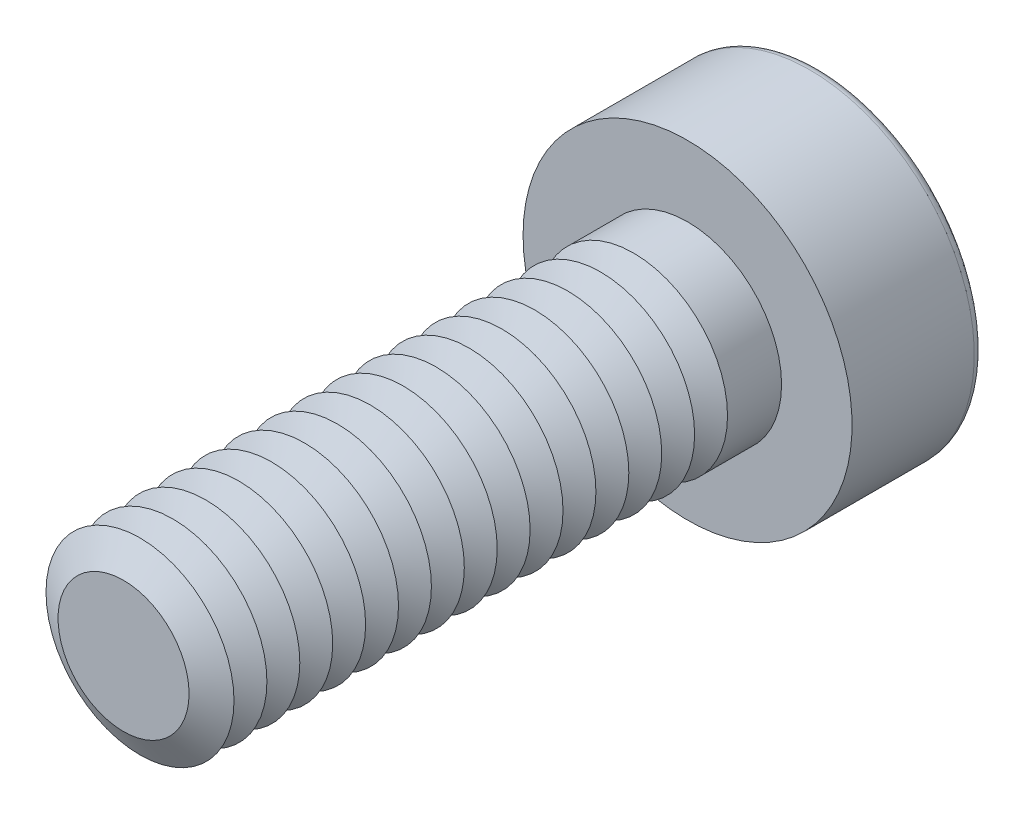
ISO-10303-21;
HEADER;
FILE_DESCRIPTION(('STEP AP214'),'2;1');
FILE_NAME('part.step','',(''),(''),'','','');
FILE_SCHEMA(('AUTOMOTIVE_DESIGN { 1 0 10303 214 1 1 1 1 }'));
ENDSEC;
DATA;
#1=APPLICATION_CONTEXT('core data for automotive mechanical design processes');
#2=APPLICATION_PROTOCOL_DEFINITION('international standard','automotive_design',2000,#1);
#3=PRODUCT_CONTEXT('',#1,'mechanical');
#4=PRODUCT('Part','Part','',(#3));
#5=PRODUCT_RELATED_PRODUCT_CATEGORY('part','',(#4));
#6=PRODUCT_DEFINITION_FORMATION('','',#4);
#7=PRODUCT_DEFINITION_CONTEXT('part definition',#1,'design');
#8=PRODUCT_DEFINITION('design','',#6,#7);
#9=PRODUCT_DEFINITION_SHAPE('','',#8);
#10=(LENGTH_UNIT() NAMED_UNIT(*) SI_UNIT(.MILLI.,.METRE.));
#11=(NAMED_UNIT(*) PLANE_ANGLE_UNIT() SI_UNIT($,.RADIAN.));
#12=(NAMED_UNIT(*) SI_UNIT($,.STERADIAN.) SOLID_ANGLE_UNIT());
#13=UNCERTAINTY_MEASURE_WITH_UNIT(LENGTH_MEASURE(1.E-05),#10,'distance_accuracy_value','');
#14=(GEOMETRIC_REPRESENTATION_CONTEXT(3) GLOBAL_UNCERTAINTY_ASSIGNED_CONTEXT((#13)) GLOBAL_UNIT_ASSIGNED_CONTEXT((#10,
#11,#12)) REPRESENTATION_CONTEXT('',''));
#15=CARTESIAN_POINT('',(0.,0.,0.));
#16=DIRECTION('',(0.,0.,1.));
#17=DIRECTION('',(1.,0.,0.));
#18=AXIS2_PLACEMENT_3D('',#15,#16,#17);
#19=CARTESIAN_POINT('',(0.,0.,9.55));
#20=DIRECTION('',(0.,0.,1.));
#21=DIRECTION('',(1.,0.,0.));
#22=AXIS2_PLACEMENT_3D('',#19,#20,#21);
#23=CONICAL_SURFACE('',#22,2.,1.0471975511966);
#24=CARTESIAN_POINT('',(0.,0.,9.2));
#25=DIRECTION('',(0.,0.,1.));
#26=DIRECTION('',(1.,0.,0.));
#27=AXIS2_PLACEMENT_3D('',#24,#25,#26);
#28=CIRCLE('',#27,1.39378221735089);
#29=CARTESIAN_POINT('',(1.39378221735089,0.,9.2));
#30=VERTEX_POINT('',#29);
#31=EDGE_CURVE('E311',#30,#30,#28,.T.);
#32=ORIENTED_EDGE('',*,*,#31,.T.);
#33=EDGE_LOOP('',(#32));
#34=FACE_BOUND('',#33,.T.);
#35=CARTESIAN_POINT('',(0.,0.,9.55));
#36=DIRECTION('',(0.,0.,1.));
#37=DIRECTION('',(1.,0.,0.));
#38=AXIS2_PLACEMENT_3D('',#35,#36,#37);
#39=CIRCLE('',#38,2.);
#40=CARTESIAN_POINT('',(2.,0.,9.55));
#41=VERTEX_POINT('',#40);
#42=EDGE_CURVE('E314',#41,#41,#39,.T.);
#43=ORIENTED_EDGE('',*,*,#42,.F.);
#44=EDGE_LOOP('',(#43));
#45=FACE_BOUND('',#44,.T.);
#46=ADVANCED_FACE('F39',(#34,#45),#23,.T.);
#47=CARTESIAN_POINT('',(0.,0.,9.2));
#48=DIRECTION('',(0.,0.,-1.));
#49=DIRECTION('',(-1.,0.,0.));
#50=AXIS2_PLACEMENT_3D('',#47,#48,#49);
#51=CONICAL_SURFACE('',#50,1.39378221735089,1.0471975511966);
#52=CARTESIAN_POINT('',(0.,0.,8.85));
#53=DIRECTION('',(0.,0.,1.));
#54=DIRECTION('',(1.,0.,0.));
#55=AXIS2_PLACEMENT_3D('',#52,#53,#54);
#56=CIRCLE('',#55,2.);
#57=CARTESIAN_POINT('',(2.,0.,8.85));
#58=VERTEX_POINT('',#57);
#59=EDGE_CURVE('E322',#58,#58,#56,.T.);
#60=ORIENTED_EDGE('',*,*,#59,.T.);
#61=EDGE_LOOP('',(#60));
#62=FACE_BOUND('',#61,.T.);
#63=ORIENTED_EDGE('',*,*,#31,.F.);
#64=EDGE_LOOP('',(#63));
#65=FACE_BOUND('',#64,.T.);
#66=ADVANCED_FACE('F245',(#62,#65),#51,.T.);
#67=CARTESIAN_POINT('',(0.,0.,12.));
#68=DIRECTION('',(0.,0.,1.));
#69=DIRECTION('',(1.,0.,0.));
#70=AXIS2_PLACEMENT_3D('',#67,#68,#69);
#71=PLANE('',#70);
#72=CARTESIAN_POINT('',(0.,0.,12.));
#73=DIRECTION('',(0.,0.,1.));
#74=DIRECTION('',(1.,0.,0.));
#75=AXIS2_PLACEMENT_3D('',#72,#73,#74);
#76=CIRCLE('',#75,1.39378221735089);
#77=CARTESIAN_POINT('',(1.39378221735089,0.,12.));
#78=VERTEX_POINT('',#77);
#79=EDGE_CURVE('E174',#78,#78,#76,.T.);
#80=ORIENTED_EDGE('',*,*,#79,.T.);
#81=EDGE_LOOP('',(#80));
#82=FACE_BOUND('',#81,.T.);
#83=ADVANCED_FACE('F251',(#82),#71,.T.);
#84=CARTESIAN_POINT('',(0.,0.,12.));
#85=DIRECTION('',(0.,0.,-1.));
#86=DIRECTION('',(-1.,0.,0.));
#87=AXIS2_PLACEMENT_3D('',#84,#85,#86);
#88=CONICAL_SURFACE('',#87,1.39378221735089,1.0471975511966);
#89=CARTESIAN_POINT('',(0.,0.,11.65));
#90=DIRECTION('',(0.,0.,1.));
#91=DIRECTION('',(1.,0.,0.));
#92=AXIS2_PLACEMENT_3D('',#89,#90,#91);
#93=CIRCLE('',#92,2.);
#94=CARTESIAN_POINT('',(2.,0.,11.65));
#95=VERTEX_POINT('',#94);
#96=EDGE_CURVE('E291',#95,#95,#93,.T.);
#97=ORIENTED_EDGE('',*,*,#96,.T.);
#98=EDGE_LOOP('',(#97));
#99=FACE_BOUND('',#98,.T.);
#100=ORIENTED_EDGE('',*,*,#79,.F.);
#101=EDGE_LOOP('',(#100));
#102=FACE_BOUND('',#101,.T.);
#103=ADVANCED_FACE('F199',(#99,#102),#88,.T.);
#104=CARTESIAN_POINT('',(0.,0.,11.65));
#105=DIRECTION('',(0.,0.,1.));
#106=DIRECTION('',(1.,0.,0.));
#107=AXIS2_PLACEMENT_3D('',#104,#105,#106);
#108=CONICAL_SURFACE('',#107,2.,1.0471975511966);
#109=CARTESIAN_POINT('',(0.,0.,11.3));
#110=DIRECTION('',(0.,0.,1.));
#111=DIRECTION('',(1.,0.,0.));
#112=AXIS2_PLACEMENT_3D('',#109,#110,#111);
#113=CIRCLE('',#112,1.39378221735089);
#114=CARTESIAN_POINT('',(1.39378221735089,0.,11.3));
#115=VERTEX_POINT('',#114);
#116=EDGE_CURVE('E288',#115,#115,#113,.T.);
#117=ORIENTED_EDGE('',*,*,#116,.T.);
#118=EDGE_LOOP('',(#117));
#119=FACE_BOUND('',#118,.T.);
#120=ORIENTED_EDGE('',*,*,#96,.F.);
#121=EDGE_LOOP('',(#120));
#122=FACE_BOUND('',#121,.T.);
#123=ADVANCED_FACE('F277',(#119,#122),#108,.T.);
#124=CARTESIAN_POINT('',(0.,0.,11.3));
#125=DIRECTION('',(0.,0.,-1.));
#126=DIRECTION('',(-1.,0.,0.));
#127=AXIS2_PLACEMENT_3D('',#124,#125,#126);
#128=CONICAL_SURFACE('',#127,1.39378221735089,1.0471975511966);
#129=CARTESIAN_POINT('',(0.,0.,10.95));
#130=DIRECTION('',(0.,0.,1.));
#131=DIRECTION('',(1.,0.,0.));
#132=AXIS2_PLACEMENT_3D('',#129,#130,#131);
#133=CIRCLE('',#132,2.);
#134=CARTESIAN_POINT('',(2.,0.,10.95));
#135=VERTEX_POINT('',#134);
#136=EDGE_CURVE('E297',#135,#135,#133,.T.);
#137=ORIENTED_EDGE('',*,*,#136,.T.);
#138=EDGE_LOOP('',(#137));
#139=FACE_BOUND('',#138,.T.);
#140=ORIENTED_EDGE('',*,*,#116,.F.);
#141=EDGE_LOOP('',(#140));
#142=FACE_BOUND('',#141,.T.);
#143=ADVANCED_FACE('F274',(#139,#142),#128,.T.);
#144=CARTESIAN_POINT('',(0.,0.,10.95));
#145=DIRECTION('',(0.,0.,1.));
#146=DIRECTION('',(1.,0.,0.));
#147=AXIS2_PLACEMENT_3D('',#144,#145,#146);
#148=CONICAL_SURFACE('',#147,2.,1.0471975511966);
#149=CARTESIAN_POINT('',(0.,0.,10.6));
#150=DIRECTION('',(0.,0.,1.));
#151=DIRECTION('',(1.,0.,0.));
#152=AXIS2_PLACEMENT_3D('',#149,#150,#151);
#153=CIRCLE('',#152,1.39378221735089);
#154=CARTESIAN_POINT('',(1.39378221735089,0.,10.6));
#155=VERTEX_POINT('',#154);
#156=EDGE_CURVE('E293',#155,#155,#153,.T.);
#157=ORIENTED_EDGE('',*,*,#156,.T.);
#158=EDGE_LOOP('',(#157));
#159=FACE_BOUND('',#158,.T.);
#160=ORIENTED_EDGE('',*,*,#136,.F.);
#161=EDGE_LOOP('',(#160));
#162=FACE_BOUND('',#161,.T.);
#163=ADVANCED_FACE('F270',(#159,#162),#148,.T.);
#164=CARTESIAN_POINT('',(0.,0.,10.6));
#165=DIRECTION('',(0.,0.,-1.));
#166=DIRECTION('',(-1.,0.,0.));
#167=AXIS2_PLACEMENT_3D('',#164,#165,#166);
#168=CONICAL_SURFACE('',#167,1.39378221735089,1.0471975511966);
#169=CARTESIAN_POINT('',(0.,0.,10.25));
#170=DIRECTION('',(0.,0.,1.));
#171=DIRECTION('',(1.,0.,0.));
#172=AXIS2_PLACEMENT_3D('',#169,#170,#171);
#173=CIRCLE('',#172,2.);
#174=CARTESIAN_POINT('',(2.,0.,10.25));
#175=VERTEX_POINT('',#174);
#176=EDGE_CURVE('E307',#175,#175,#173,.T.);
#177=ORIENTED_EDGE('',*,*,#176,.T.);
#178=EDGE_LOOP('',(#177));
#179=FACE_BOUND('',#178,.T.);
#180=ORIENTED_EDGE('',*,*,#156,.F.);
#181=EDGE_LOOP('',(#180));
#182=FACE_BOUND('',#181,.T.);
#183=ADVANCED_FACE('F266',(#179,#182),#168,.T.);
#184=CARTESIAN_POINT('',(0.,0.,10.25));
#185=DIRECTION('',(0.,0.,1.));
#186=DIRECTION('',(1.,0.,0.));
#187=AXIS2_PLACEMENT_3D('',#184,#185,#186);
#188=CONICAL_SURFACE('',#187,2.,1.0471975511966);
#189=CARTESIAN_POINT('',(0.,0.,9.9));
#190=DIRECTION('',(0.,0.,1.));
#191=DIRECTION('',(1.,0.,0.));
#192=AXIS2_PLACEMENT_3D('',#189,#190,#191);
#193=CIRCLE('',#192,1.39378221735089);
#194=CARTESIAN_POINT('',(1.39378221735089,0.,9.9));
#195=VERTEX_POINT('',#194);
#196=EDGE_CURVE('E303',#195,#195,#193,.T.);
#197=ORIENTED_EDGE('',*,*,#196,.T.);
#198=EDGE_LOOP('',(#197));
#199=FACE_BOUND('',#198,.T.);
#200=ORIENTED_EDGE('',*,*,#176,.F.);
#201=EDGE_LOOP('',(#200));
#202=FACE_BOUND('',#201,.T.);
#203=ADVANCED_FACE('F262',(#199,#202),#188,.T.);
#204=CARTESIAN_POINT('',(0.,0.,9.9));
#205=DIRECTION('',(0.,0.,-1.));
#206=DIRECTION('',(-1.,0.,0.));
#207=AXIS2_PLACEMENT_3D('',#204,#205,#206);
#208=CONICAL_SURFACE('',#207,1.39378221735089,1.0471975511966);
#209=ORIENTED_EDGE('',*,*,#42,.T.);
#210=EDGE_LOOP('',(#209));
#211=FACE_BOUND('',#210,.T.);
#212=ORIENTED_EDGE('',*,*,#196,.F.);
#213=EDGE_LOOP('',(#212));
#214=FACE_BOUND('',#213,.T.);
#215=ADVANCED_FACE('F258',(#211,#214),#208,.T.);
#216=CARTESIAN_POINT('',(0.,0.,8.85));
#217=DIRECTION('',(0.,0.,1.));
#218=DIRECTION('',(1.,0.,0.));
#219=AXIS2_PLACEMENT_3D('',#216,#217,#218);
#220=CONICAL_SURFACE('',#219,2.,1.0471975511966);
#221=CARTESIAN_POINT('',(0.,0.,8.5));
#222=DIRECTION('',(0.,0.,1.));
#223=DIRECTION('',(1.,0.,0.));
#224=AXIS2_PLACEMENT_3D('',#221,#222,#223);
#225=CIRCLE('',#224,1.39378221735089);
#226=CARTESIAN_POINT('',(1.39378221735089,0.,8.5));
#227=VERTEX_POINT('',#226);
#228=EDGE_CURVE('E318',#227,#227,#225,.T.);
#229=ORIENTED_EDGE('',*,*,#228,.T.);
#230=EDGE_LOOP('',(#229));
#231=FACE_BOUND('',#230,.T.);
#232=ORIENTED_EDGE('',*,*,#59,.F.);
#233=EDGE_LOOP('',(#232));
#234=FACE_BOUND('',#233,.T.);
#235=ADVANCED_FACE('F261',(#231,#234),#220,.T.);
#236=CARTESIAN_POINT('',(0.,0.,8.5));
#237=DIRECTION('',(0.,0.,-1.));
#238=DIRECTION('',(-1.,0.,0.));
#239=AXIS2_PLACEMENT_3D('',#236,#237,#238);
#240=CONICAL_SURFACE('',#239,1.39378221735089,1.0471975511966);
#241=CARTESIAN_POINT('',(0.,0.,8.15));
#242=DIRECTION('',(0.,0.,1.));
#243=DIRECTION('',(1.,0.,0.));
#244=AXIS2_PLACEMENT_3D('',#241,#242,#243);
#245=CIRCLE('',#244,2.);
#246=CARTESIAN_POINT('',(2.,0.,8.15));
#247=VERTEX_POINT('',#246);
#248=EDGE_CURVE('E330',#247,#247,#245,.T.);
#249=ORIENTED_EDGE('',*,*,#248,.T.);
#250=EDGE_LOOP('',(#249));
#251=FACE_BOUND('',#250,.T.);
#252=ORIENTED_EDGE('',*,*,#228,.F.);
#253=EDGE_LOOP('',(#252));
#254=FACE_BOUND('',#253,.T.);
#255=ADVANCED_FACE('F496',(#251,#254),#240,.T.);
#256=CARTESIAN_POINT('',(0.,0.,8.15));
#257=DIRECTION('',(0.,0.,1.));
#258=DIRECTION('',(1.,0.,0.));
#259=AXIS2_PLACEMENT_3D('',#256,#257,#258);
#260=CONICAL_SURFACE('',#259,2.,1.0471975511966);
#261=CARTESIAN_POINT('',(0.,0.,7.8));
#262=DIRECTION('',(0.,0.,1.));
#263=DIRECTION('',(1.,0.,0.));
#264=AXIS2_PLACEMENT_3D('',#261,#262,#263);
#265=CIRCLE('',#264,1.39378221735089);
#266=CARTESIAN_POINT('',(1.39378221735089,0.,7.8));
#267=VERTEX_POINT('',#266);
#268=EDGE_CURVE('E326',#267,#267,#265,.T.);
#269=ORIENTED_EDGE('',*,*,#268,.T.);
#270=EDGE_LOOP('',(#269));
#271=FACE_BOUND('',#270,.T.);
#272=ORIENTED_EDGE('',*,*,#248,.F.);
#273=EDGE_LOOP('',(#272));
#274=FACE_BOUND('',#273,.T.);
#275=ADVANCED_FACE('F492',(#271,#274),#260,.T.);
#276=CARTESIAN_POINT('',(0.,0.,7.8));
#277=DIRECTION('',(0.,0.,-1.));
#278=DIRECTION('',(-1.,0.,0.));
#279=AXIS2_PLACEMENT_3D('',#276,#277,#278);
#280=CONICAL_SURFACE('',#279,1.39378221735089,1.0471975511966);
#281=CARTESIAN_POINT('',(0.,0.,7.45));
#282=DIRECTION('',(0.,0.,1.));
#283=DIRECTION('',(1.,0.,0.));
#284=AXIS2_PLACEMENT_3D('',#281,#282,#283);
#285=CIRCLE('',#284,2.);
#286=CARTESIAN_POINT('',(2.,0.,7.45));
#287=VERTEX_POINT('',#286);
#288=EDGE_CURVE('E338',#287,#287,#285,.T.);
#289=ORIENTED_EDGE('',*,*,#288,.T.);
#290=EDGE_LOOP('',(#289));
#291=FACE_BOUND('',#290,.T.);
#292=ORIENTED_EDGE('',*,*,#268,.F.);
#293=EDGE_LOOP('',(#292));
#294=FACE_BOUND('',#293,.T.);
#295=ADVANCED_FACE('F488',(#291,#294),#280,.T.);
#296=CARTESIAN_POINT('',(0.,0.,7.45));
#297=DIRECTION('',(0.,0.,1.));
#298=DIRECTION('',(1.,0.,0.));
#299=AXIS2_PLACEMENT_3D('',#296,#297,#298);
#300=CONICAL_SURFACE('',#299,2.,1.0471975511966);
#301=CARTESIAN_POINT('',(0.,0.,7.1));
#302=DIRECTION('',(0.,0.,1.));
#303=DIRECTION('',(1.,0.,0.));
#304=AXIS2_PLACEMENT_3D('',#301,#302,#303);
#305=CIRCLE('',#304,1.39378221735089);
#306=CARTESIAN_POINT('',(1.39378221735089,0.,7.1));
#307=VERTEX_POINT('',#306);
#308=EDGE_CURVE('E334',#307,#307,#305,.T.);
#309=ORIENTED_EDGE('',*,*,#308,.T.);
#310=EDGE_LOOP('',(#309));
#311=FACE_BOUND('',#310,.T.);
#312=ORIENTED_EDGE('',*,*,#288,.F.);
#313=EDGE_LOOP('',(#312));
#314=FACE_BOUND('',#313,.T.);
#315=ADVANCED_FACE('F484',(#311,#314),#300,.T.);
#316=CARTESIAN_POINT('',(0.,0.,7.1));
#317=DIRECTION('',(0.,0.,-1.));
#318=DIRECTION('',(-1.,0.,0.));
#319=AXIS2_PLACEMENT_3D('',#316,#317,#318);
#320=CONICAL_SURFACE('',#319,1.39378221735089,1.0471975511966);
#321=CARTESIAN_POINT('',(0.,0.,6.75));
#322=DIRECTION('',(0.,0.,1.));
#323=DIRECTION('',(1.,0.,0.));
#324=AXIS2_PLACEMENT_3D('',#321,#322,#323);
#325=CIRCLE('',#324,2.);
#326=CARTESIAN_POINT('',(2.,0.,6.75));
#327=VERTEX_POINT('',#326);
#328=EDGE_CURVE('E346',#327,#327,#325,.T.);
#329=ORIENTED_EDGE('',*,*,#328,.T.);
#330=EDGE_LOOP('',(#329));
#331=FACE_BOUND('',#330,.T.);
#332=ORIENTED_EDGE('',*,*,#308,.F.);
#333=EDGE_LOOP('',(#332));
#334=FACE_BOUND('',#333,.T.);
#335=ADVANCED_FACE('F480',(#331,#334),#320,.T.);
#336=CARTESIAN_POINT('',(0.,0.,6.75));
#337=DIRECTION('',(0.,0.,1.));
#338=DIRECTION('',(1.,0.,0.));
#339=AXIS2_PLACEMENT_3D('',#336,#337,#338);
#340=CONICAL_SURFACE('',#339,2.,1.0471975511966);
#341=CARTESIAN_POINT('',(0.,0.,6.4));
#342=DIRECTION('',(0.,0.,1.));
#343=DIRECTION('',(1.,0.,0.));
#344=AXIS2_PLACEMENT_3D('',#341,#342,#343);
#345=CIRCLE('',#344,1.39378221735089);
#346=CARTESIAN_POINT('',(1.39378221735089,0.,6.4));
#347=VERTEX_POINT('',#346);
#348=EDGE_CURVE('E342',#347,#347,#345,.T.);
#349=ORIENTED_EDGE('',*,*,#348,.T.);
#350=EDGE_LOOP('',(#349));
#351=FACE_BOUND('',#350,.T.);
#352=ORIENTED_EDGE('',*,*,#328,.F.);
#353=EDGE_LOOP('',(#352));
#354=FACE_BOUND('',#353,.T.);
#355=ADVANCED_FACE('F476',(#351,#354),#340,.T.);
#356=CARTESIAN_POINT('',(0.,0.,6.4));
#357=DIRECTION('',(0.,0.,-1.));
#358=DIRECTION('',(-1.,0.,0.));
#359=AXIS2_PLACEMENT_3D('',#356,#357,#358);
#360=CONICAL_SURFACE('',#359,1.39378221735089,1.0471975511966);
#361=CARTESIAN_POINT('',(0.,0.,6.05));
#362=DIRECTION('',(0.,0.,1.));
#363=DIRECTION('',(1.,0.,0.));
#364=AXIS2_PLACEMENT_3D('',#361,#362,#363);
#365=CIRCLE('',#364,2.);
#366=CARTESIAN_POINT('',(2.,0.,6.05));
#367=VERTEX_POINT('',#366);
#368=EDGE_CURVE('E354',#367,#367,#365,.T.);
#369=ORIENTED_EDGE('',*,*,#368,.T.);
#370=EDGE_LOOP('',(#369));
#371=FACE_BOUND('',#370,.T.);
#372=ORIENTED_EDGE('',*,*,#348,.F.);
#373=EDGE_LOOP('',(#372));
#374=FACE_BOUND('',#373,.T.);
#375=ADVANCED_FACE('F472',(#371,#374),#360,.T.);
#376=CARTESIAN_POINT('',(0.,0.,6.05));
#377=DIRECTION('',(0.,0.,1.));
#378=DIRECTION('',(1.,0.,0.));
#379=AXIS2_PLACEMENT_3D('',#376,#377,#378);
#380=CONICAL_SURFACE('',#379,2.,1.0471975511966);
#381=CARTESIAN_POINT('',(0.,0.,5.7));
#382=DIRECTION('',(0.,0.,1.));
#383=DIRECTION('',(1.,0.,0.));
#384=AXIS2_PLACEMENT_3D('',#381,#382,#383);
#385=CIRCLE('',#384,1.39378221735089);
#386=CARTESIAN_POINT('',(1.39378221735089,0.,5.7));
#387=VERTEX_POINT('',#386);
#388=EDGE_CURVE('E350',#387,#387,#385,.T.);
#389=ORIENTED_EDGE('',*,*,#388,.T.);
#390=EDGE_LOOP('',(#389));
#391=FACE_BOUND('',#390,.T.);
#392=ORIENTED_EDGE('',*,*,#368,.F.);
#393=EDGE_LOOP('',(#392));
#394=FACE_BOUND('',#393,.T.);
#395=ADVANCED_FACE('F468',(#391,#394),#380,.T.);
#396=CARTESIAN_POINT('',(0.,0.,5.7));
#397=DIRECTION('',(0.,0.,-1.));
#398=DIRECTION('',(-1.,0.,0.));
#399=AXIS2_PLACEMENT_3D('',#396,#397,#398);
#400=CONICAL_SURFACE('',#399,1.39378221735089,1.0471975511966);
#401=CARTESIAN_POINT('',(0.,0.,5.35));
#402=DIRECTION('',(0.,0.,1.));
#403=DIRECTION('',(1.,0.,0.));
#404=AXIS2_PLACEMENT_3D('',#401,#402,#403);
#405=CIRCLE('',#404,2.);
#406=CARTESIAN_POINT('',(2.,0.,5.35));
#407=VERTEX_POINT('',#406);
#408=EDGE_CURVE('E362',#407,#407,#405,.T.);
#409=ORIENTED_EDGE('',*,*,#408,.T.);
#410=EDGE_LOOP('',(#409));
#411=FACE_BOUND('',#410,.T.);
#412=ORIENTED_EDGE('',*,*,#388,.F.);
#413=EDGE_LOOP('',(#412));
#414=FACE_BOUND('',#413,.T.);
#415=ADVANCED_FACE('F464',(#411,#414),#400,.T.);
#416=CARTESIAN_POINT('',(0.,0.,5.35));
#417=DIRECTION('',(0.,0.,1.));
#418=DIRECTION('',(1.,0.,0.));
#419=AXIS2_PLACEMENT_3D('',#416,#417,#418);
#420=CONICAL_SURFACE('',#419,2.,1.0471975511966);
#421=CARTESIAN_POINT('',(0.,0.,5.));
#422=DIRECTION('',(0.,0.,1.));
#423=DIRECTION('',(1.,0.,0.));
#424=AXIS2_PLACEMENT_3D('',#421,#422,#423);
#425=CIRCLE('',#424,1.39378221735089);
#426=CARTESIAN_POINT('',(1.39378221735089,0.,5.));
#427=VERTEX_POINT('',#426);
#428=EDGE_CURVE('E358',#427,#427,#425,.T.);
#429=ORIENTED_EDGE('',*,*,#428,.T.);
#430=EDGE_LOOP('',(#429));
#431=FACE_BOUND('',#430,.T.);
#432=ORIENTED_EDGE('',*,*,#408,.F.);
#433=EDGE_LOOP('',(#432));
#434=FACE_BOUND('',#433,.T.);
#435=ADVANCED_FACE('F460',(#431,#434),#420,.T.);
#436=CARTESIAN_POINT('',(0.,0.,5.));
#437=DIRECTION('',(0.,0.,-1.));
#438=DIRECTION('',(-1.,0.,0.));
#439=AXIS2_PLACEMENT_3D('',#436,#437,#438);
#440=CONICAL_SURFACE('',#439,1.39378221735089,1.0471975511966);
#441=CARTESIAN_POINT('',(0.,0.,4.65));
#442=DIRECTION('',(0.,0.,1.));
#443=DIRECTION('',(1.,0.,0.));
#444=AXIS2_PLACEMENT_3D('',#441,#442,#443);
#445=CIRCLE('',#444,2.);
#446=CARTESIAN_POINT('',(2.,0.,4.65));
#447=VERTEX_POINT('',#446);
#448=EDGE_CURVE('E370',#447,#447,#445,.T.);
#449=ORIENTED_EDGE('',*,*,#448,.T.);
#450=EDGE_LOOP('',(#449));
#451=FACE_BOUND('',#450,.T.);
#452=ORIENTED_EDGE('',*,*,#428,.F.);
#453=EDGE_LOOP('',(#452));
#454=FACE_BOUND('',#453,.T.);
#455=ADVANCED_FACE('F456',(#451,#454),#440,.T.);
#456=CARTESIAN_POINT('',(0.,0.,4.65));
#457=DIRECTION('',(0.,0.,1.));
#458=DIRECTION('',(1.,0.,0.));
#459=AXIS2_PLACEMENT_3D('',#456,#457,#458);
#460=CONICAL_SURFACE('',#459,2.,1.0471975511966);
#461=CARTESIAN_POINT('',(0.,0.,4.3));
#462=DIRECTION('',(0.,0.,1.));
#463=DIRECTION('',(1.,0.,0.));
#464=AXIS2_PLACEMENT_3D('',#461,#462,#463);
#465=CIRCLE('',#464,1.39378221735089);
#466=CARTESIAN_POINT('',(1.39378221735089,0.,4.3));
#467=VERTEX_POINT('',#466);
#468=EDGE_CURVE('E366',#467,#467,#465,.T.);
#469=ORIENTED_EDGE('',*,*,#468,.T.);
#470=EDGE_LOOP('',(#469));
#471=FACE_BOUND('',#470,.T.);
#472=ORIENTED_EDGE('',*,*,#448,.F.);
#473=EDGE_LOOP('',(#472));
#474=FACE_BOUND('',#473,.T.);
#475=ADVANCED_FACE('F452',(#471,#474),#460,.T.);
#476=CARTESIAN_POINT('',(0.,0.,4.3));
#477=DIRECTION('',(0.,0.,-1.));
#478=DIRECTION('',(-1.,0.,0.));
#479=AXIS2_PLACEMENT_3D('',#476,#477,#478);
#480=CONICAL_SURFACE('',#479,1.39378221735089,1.0471975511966);
#481=CARTESIAN_POINT('',(0.,0.,3.95));
#482=DIRECTION('',(0.,0.,1.));
#483=DIRECTION('',(1.,0.,0.));
#484=AXIS2_PLACEMENT_3D('',#481,#482,#483);
#485=CIRCLE('',#484,2.);
#486=CARTESIAN_POINT('',(2.,0.,3.95));
#487=VERTEX_POINT('',#486);
#488=EDGE_CURVE('E378',#487,#487,#485,.T.);
#489=ORIENTED_EDGE('',*,*,#488,.T.);
#490=EDGE_LOOP('',(#489));
#491=FACE_BOUND('',#490,.T.);
#492=ORIENTED_EDGE('',*,*,#468,.F.);
#493=EDGE_LOOP('',(#492));
#494=FACE_BOUND('',#493,.T.);
#495=ADVANCED_FACE('F448',(#491,#494),#480,.T.);
#496=CARTESIAN_POINT('',(0.,0.,3.95));
#497=DIRECTION('',(0.,0.,1.));
#498=DIRECTION('',(1.,0.,0.));
#499=AXIS2_PLACEMENT_3D('',#496,#497,#498);
#500=CONICAL_SURFACE('',#499,2.,1.0471975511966);
#501=CARTESIAN_POINT('',(0.,0.,3.6));
#502=DIRECTION('',(0.,0.,1.));
#503=DIRECTION('',(1.,0.,0.));
#504=AXIS2_PLACEMENT_3D('',#501,#502,#503);
#505=CIRCLE('',#504,1.39378221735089);
#506=CARTESIAN_POINT('',(1.39378221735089,0.,3.6));
#507=VERTEX_POINT('',#506);
#508=EDGE_CURVE('E374',#507,#507,#505,.T.);
#509=ORIENTED_EDGE('',*,*,#508,.T.);
#510=EDGE_LOOP('',(#509));
#511=FACE_BOUND('',#510,.T.);
#512=ORIENTED_EDGE('',*,*,#488,.F.);
#513=EDGE_LOOP('',(#512));
#514=FACE_BOUND('',#513,.T.);
#515=ADVANCED_FACE('F444',(#511,#514),#500,.T.);
#516=CARTESIAN_POINT('',(0.,0.,3.6));
#517=DIRECTION('',(0.,0.,-1.));
#518=DIRECTION('',(-1.,0.,0.));
#519=AXIS2_PLACEMENT_3D('',#516,#517,#518);
#520=CONICAL_SURFACE('',#519,1.39378221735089,1.0471975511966);
#521=CARTESIAN_POINT('',(0.,0.,3.25));
#522=DIRECTION('',(0.,0.,1.));
#523=DIRECTION('',(1.,0.,0.));
#524=AXIS2_PLACEMENT_3D('',#521,#522,#523);
#525=CIRCLE('',#524,2.);
#526=CARTESIAN_POINT('',(2.,0.,3.25));
#527=VERTEX_POINT('',#526);
#528=EDGE_CURVE('E386',#527,#527,#525,.T.);
#529=ORIENTED_EDGE('',*,*,#528,.T.);
#530=EDGE_LOOP('',(#529));
#531=FACE_BOUND('',#530,.T.);
#532=ORIENTED_EDGE('',*,*,#508,.F.);
#533=EDGE_LOOP('',(#532));
#534=FACE_BOUND('',#533,.T.);
#535=ADVANCED_FACE('F440',(#531,#534),#520,.T.);
#536=CARTESIAN_POINT('',(0.,0.,3.25));
#537=DIRECTION('',(0.,0.,1.));
#538=DIRECTION('',(1.,0.,0.));
#539=AXIS2_PLACEMENT_3D('',#536,#537,#538);
#540=CONICAL_SURFACE('',#539,2.,1.0471975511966);
#541=CARTESIAN_POINT('',(0.,0.,2.9));
#542=DIRECTION('',(0.,0.,1.));
#543=DIRECTION('',(1.,0.,0.));
#544=AXIS2_PLACEMENT_3D('',#541,#542,#543);
#545=CIRCLE('',#544,1.39378221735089);
#546=CARTESIAN_POINT('',(1.39378221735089,0.,2.9));
#547=VERTEX_POINT('',#546);
#548=EDGE_CURVE('E382',#547,#547,#545,.T.);
#549=ORIENTED_EDGE('',*,*,#548,.T.);
#550=EDGE_LOOP('',(#549));
#551=FACE_BOUND('',#550,.T.);
#552=ORIENTED_EDGE('',*,*,#528,.F.);
#553=EDGE_LOOP('',(#552));
#554=FACE_BOUND('',#553,.T.);
#555=ADVANCED_FACE('F436',(#551,#554),#540,.T.);
#556=CARTESIAN_POINT('',(0.,0.,2.9));
#557=DIRECTION('',(0.,0.,-1.));
#558=DIRECTION('',(-1.,0.,0.));
#559=AXIS2_PLACEMENT_3D('',#556,#557,#558);
#560=CONICAL_SURFACE('',#559,1.39378221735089,1.0471975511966);
#561=CARTESIAN_POINT('',(0.,0.,2.55));
#562=DIRECTION('',(0.,0.,1.));
#563=DIRECTION('',(1.,0.,0.));
#564=AXIS2_PLACEMENT_3D('',#561,#562,#563);
#565=CIRCLE('',#564,2.);
#566=CARTESIAN_POINT('',(2.,0.,2.55));
#567=VERTEX_POINT('',#566);
#568=EDGE_CURVE('E394',#567,#567,#565,.T.);
#569=ORIENTED_EDGE('',*,*,#568,.T.);
#570=EDGE_LOOP('',(#569));
#571=FACE_BOUND('',#570,.T.);
#572=ORIENTED_EDGE('',*,*,#548,.F.);
#573=EDGE_LOOP('',(#572));
#574=FACE_BOUND('',#573,.T.);
#575=ADVANCED_FACE('F432',(#571,#574),#560,.T.);
#576=CARTESIAN_POINT('',(0.,0.,2.55));
#577=DIRECTION('',(0.,0.,1.));
#578=DIRECTION('',(1.,0.,0.));
#579=AXIS2_PLACEMENT_3D('',#576,#577,#578);
#580=CONICAL_SURFACE('',#579,2.,1.0471975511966);
#581=CARTESIAN_POINT('',(0.,0.,2.2));
#582=DIRECTION('',(0.,0.,1.));
#583=DIRECTION('',(1.,0.,0.));
#584=AXIS2_PLACEMENT_3D('',#581,#582,#583);
#585=CIRCLE('',#584,1.39378221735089);
#586=CARTESIAN_POINT('',(1.39378221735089,0.,2.2));
#587=VERTEX_POINT('',#586);
#588=EDGE_CURVE('E390',#587,#587,#585,.T.);
#589=ORIENTED_EDGE('',*,*,#588,.T.);
#590=EDGE_LOOP('',(#589));
#591=FACE_BOUND('',#590,.T.);
#592=ORIENTED_EDGE('',*,*,#568,.F.);
#593=EDGE_LOOP('',(#592));
#594=FACE_BOUND('',#593,.T.);
#595=ADVANCED_FACE('F427',(#591,#594),#580,.T.);
#596=CARTESIAN_POINT('',(0.,0.,2.2));
#597=DIRECTION('',(0.,0.,-1.));
#598=DIRECTION('',(-1.,0.,0.));
#599=AXIS2_PLACEMENT_3D('',#596,#597,#598);
#600=CONICAL_SURFACE('',#599,1.39378221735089,1.0471975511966);
#601=CARTESIAN_POINT('',(0.,0.,1.85));
#602=DIRECTION('',(0.,0.,1.));
#603=DIRECTION('',(1.,0.,0.));
#604=AXIS2_PLACEMENT_3D('',#601,#602,#603);
#605=CIRCLE('',#604,2.);
#606=CARTESIAN_POINT('',(2.,0.,1.85));
#607=VERTEX_POINT('',#606);
#608=EDGE_CURVE('E406',#607,#607,#605,.T.);
#609=ORIENTED_EDGE('',*,*,#608,.T.);
#610=EDGE_LOOP('',(#609));
#611=FACE_BOUND('',#610,.T.);
#612=ORIENTED_EDGE('',*,*,#588,.F.);
#613=EDGE_LOOP('',(#612));
#614=FACE_BOUND('',#613,.T.);
#615=ADVANCED_FACE('F413',(#611,#614),#600,.T.);
#616=CARTESIAN_POINT('',(0.,0.,1.85));
#617=DIRECTION('',(0.,0.,1.));
#618=DIRECTION('',(1.,0.,0.));
#619=AXIS2_PLACEMENT_3D('',#616,#617,#618);
#620=CONICAL_SURFACE('',#619,2.,1.0471975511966);
#621=CARTESIAN_POINT('',(0.,0.,1.5));
#622=DIRECTION('',(0.,0.,1.));
#623=DIRECTION('',(1.,0.,0.));
#624=AXIS2_PLACEMENT_3D('',#621,#622,#623);
#625=CIRCLE('',#624,1.39378221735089);
#626=CARTESIAN_POINT('',(1.39378221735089,0.,1.5));
#627=VERTEX_POINT('',#626);
#628=EDGE_CURVE('E398',#627,#627,#625,.T.);
#629=ORIENTED_EDGE('',*,*,#628,.T.);
#630=EDGE_LOOP('',(#629));
#631=FACE_BOUND('',#630,.T.);
#632=ORIENTED_EDGE('',*,*,#608,.F.);
#633=EDGE_LOOP('',(#632));
#634=FACE_BOUND('',#633,.T.);
#635=ADVANCED_FACE('F416',(#631,#634),#620,.T.);
#636=CARTESIAN_POINT('',(0.,0.,1.5));
#637=DIRECTION('',(0.,0.,-1.));
#638=DIRECTION('',(-1.,0.,0.));
#639=AXIS2_PLACEMENT_3D('',#636,#637,#638);
#640=CONICAL_SURFACE('',#639,1.39378221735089,1.0471975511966);
#641=CARTESIAN_POINT('',(0.,0.,1.15));
#642=DIRECTION('',(0.,0.,1.));
#643=DIRECTION('',(1.,0.,0.));
#644=AXIS2_PLACEMENT_3D('',#641,#642,#643);
#645=CIRCLE('',#644,2.);
#646=CARTESIAN_POINT('',(2.,0.,1.15));
#647=VERTEX_POINT('',#646);
#648=EDGE_CURVE('E402',#647,#647,#645,.T.);
#649=ORIENTED_EDGE('',*,*,#648,.T.);
#650=EDGE_LOOP('',(#649));
#651=FACE_BOUND('',#650,.T.);
#652=ORIENTED_EDGE('',*,*,#628,.F.);
#653=EDGE_LOOP('',(#652));
#654=FACE_BOUND('',#653,.T.);
#655=ADVANCED_FACE('F418',(#651,#654),#640,.T.);
#656=CARTESIAN_POINT('',(0.,0.,-0.925));
#657=DIRECTION('',(0.,0.,-1.));
#658=DIRECTION('',(-1.,0.,0.));
#659=AXIS2_PLACEMENT_3D('',#656,#657,#658);
#660=CONICAL_SURFACE('',#659,1.25,1.0471975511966);
#661=CARTESIAN_POINT('',(0.,0.,-0.203312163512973));
#662=VERTEX_POINT('',#661);
#663=VERTEX_LOOP('',#662);
#664=FACE_BOUND('',#663,.T.);
#665=CARTESIAN_POINT('',(0.,0.,-0.925));
#666=DIRECTION('',(0.,0.,-1.));
#667=DIRECTION('',(-1.,0.,0.));
#668=AXIS2_PLACEMENT_3D('',#665,#666,#667);
#669=CIRCLE('',#668,1.25);
#670=CARTESIAN_POINT('',(-1.08253175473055,0.624999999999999,-0.925));
#671=VERTEX_POINT('',#670);
#672=CARTESIAN_POINT('',(0.,1.25,-0.925));
#673=VERTEX_POINT('',#672);
#674=EDGE_CURVE('E149',#671,#673,#669,.T.);
#675=ORIENTED_EDGE('',*,*,#674,.T.);
#676=CARTESIAN_POINT('',(0.,0.,-0.925));
#677=DIRECTION('',(0.,0.,-1.));
#678=DIRECTION('',(-1.,0.,0.));
#679=AXIS2_PLACEMENT_3D('',#676,#677,#678);
#680=CIRCLE('',#679,1.25);
#681=CARTESIAN_POINT('',(1.08253175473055,0.625,-0.925));
#682=VERTEX_POINT('',#681);
#683=EDGE_CURVE('E54',#673,#682,#680,.T.);
#684=ORIENTED_EDGE('',*,*,#683,.T.);
#685=CARTESIAN_POINT('',(1.08253175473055,-0.624999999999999,-0.925));
#686=VERTEX_POINT('',#685);
#687=EDGE_CURVE('E995',#682,#686,#680,.T.);
#688=ORIENTED_EDGE('',*,*,#687,.T.);
#689=CARTESIAN_POINT('',(0.,-1.25,-0.925));
#690=VERTEX_POINT('',#689);
#691=EDGE_CURVE('E994',#686,#690,#680,.T.);
#692=ORIENTED_EDGE('',*,*,#691,.T.);
#693=CARTESIAN_POINT('',(-1.08253175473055,-0.624999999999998,-0.925));
#694=VERTEX_POINT('',#693);
#695=EDGE_CURVE('E988',#690,#694,#680,.T.);
#696=ORIENTED_EDGE('',*,*,#695,.T.);
#697=EDGE_CURVE('E986',#694,#671,#680,.T.);
#698=ORIENTED_EDGE('',*,*,#697,.T.);
#699=EDGE_LOOP('',(#675,#684,#688,#692,#696,#698));
#700=FACE_BOUND('',#699,.T.);
#701=ADVANCED_FACE('F201',(#664,#700),#660,.F.);
#702=CARTESIAN_POINT('',(0.,0.,-0.925));
#703=DIRECTION('',(0.,0.,-1.));
#704=DIRECTION('',(-1.,0.,0.));
#705=AXIS2_PLACEMENT_3D('',#702,#703,#704);
#706=PLANE('',#705);
#707=ORIENTED_EDGE('',*,*,#683,.F.);
#708=DIRECTION('',(1.,0.,0.));
#709=VECTOR('',#708,1.);
#710=CARTESIAN_POINT('',(-0.721687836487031,1.25,-0.925));
#711=LINE('',#710,#709);
#712=CARTESIAN_POINT('',(0.721687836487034,1.25,-0.925));
#713=VERTEX_POINT('',#712);
#714=EDGE_CURVE('E1041',#673,#713,#711,.T.);
#715=ORIENTED_EDGE('',*,*,#714,.T.);
#716=DIRECTION('',(0.5,-0.866025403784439,0.));
#717=VECTOR('',#716,1.);
#718=CARTESIAN_POINT('',(0.721687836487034,1.25,-0.925));
#719=LINE('',#718,#717);
#720=EDGE_CURVE('E155',#713,#682,#719,.T.);
#721=ORIENTED_EDGE('',*,*,#720,.T.);
#722=EDGE_LOOP('',(#707,#715,#721));
#723=FACE_BOUND('',#722,.T.);
#724=ADVANCED_FACE('F585',(#723),#706,.T.);
#725=ORIENTED_EDGE('',*,*,#687,.F.);
#726=CARTESIAN_POINT('',(1.44337567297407,0.,-0.925));
#727=VERTEX_POINT('',#726);
#728=EDGE_CURVE('E1032',#682,#727,#719,.T.);
#729=ORIENTED_EDGE('',*,*,#728,.T.);
#730=DIRECTION('',(-0.5,-0.866025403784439,0.));
#731=VECTOR('',#730,1.);
#732=CARTESIAN_POINT('',(1.44337567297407,0.,-0.925));
#733=LINE('',#732,#731);
#734=EDGE_CURVE('E1008',#727,#686,#733,.T.);
#735=ORIENTED_EDGE('',*,*,#734,.T.);
#736=EDGE_LOOP('',(#725,#729,#735));
#737=FACE_BOUND('',#736,.T.);
#738=ADVANCED_FACE('F595',(#737),#706,.T.);
#739=ORIENTED_EDGE('',*,*,#691,.F.);
#740=CARTESIAN_POINT('',(0.721687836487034,-1.25,-0.925));
#741=VERTEX_POINT('',#740);
#742=EDGE_CURVE('E1010',#686,#741,#733,.T.);
#743=ORIENTED_EDGE('',*,*,#742,.T.);
#744=DIRECTION('',(-1.,0.,0.));
#745=VECTOR('',#744,1.);
#746=CARTESIAN_POINT('',(0.721687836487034,-1.25,-0.925));
#747=LINE('',#746,#745);
#748=EDGE_CURVE('E961',#741,#690,#747,.T.);
#749=ORIENTED_EDGE('',*,*,#748,.T.);
#750=EDGE_LOOP('',(#739,#743,#749));
#751=FACE_BOUND('',#750,.T.);
#752=ADVANCED_FACE('F605',(#751),#706,.T.);
#753=ORIENTED_EDGE('',*,*,#695,.F.);
#754=CARTESIAN_POINT('',(-0.721687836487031,-1.25,-0.925));
#755=VERTEX_POINT('',#754);
#756=EDGE_CURVE('E1004',#690,#755,#747,.T.);
#757=ORIENTED_EDGE('',*,*,#756,.T.);
#758=DIRECTION('',(-0.499999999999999,0.866025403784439,0.));
#759=VECTOR('',#758,1.);
#760=CARTESIAN_POINT('',(-0.721687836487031,-1.25,-0.925));
#761=LINE('',#760,#759);
#762=EDGE_CURVE('E1006',#755,#694,#761,.T.);
#763=ORIENTED_EDGE('',*,*,#762,.T.);
#764=EDGE_LOOP('',(#753,#757,#763));
#765=FACE_BOUND('',#764,.T.);
#766=ADVANCED_FACE('F613',(#765),#706,.T.);
#767=ORIENTED_EDGE('',*,*,#697,.F.);
#768=CARTESIAN_POINT('',(-1.44337567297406,0.,-0.925));
#769=VERTEX_POINT('',#768);
#770=EDGE_CURVE('E1011',#694,#769,#761,.T.);
#771=ORIENTED_EDGE('',*,*,#770,.T.);
#772=DIRECTION('',(0.499999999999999,0.866025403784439,0.));
#773=VECTOR('',#772,1.);
#774=CARTESIAN_POINT('',(-1.44337567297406,0.,-0.925));
#775=LINE('',#774,#773);
#776=EDGE_CURVE('E158',#769,#671,#775,.T.);
#777=ORIENTED_EDGE('',*,*,#776,.T.);
#778=EDGE_LOOP('',(#767,#771,#777));
#779=FACE_BOUND('',#778,.T.);
#780=ADVANCED_FACE('F231',(#779),#706,.T.);
#781=ORIENTED_EDGE('',*,*,#674,.F.);
#782=CARTESIAN_POINT('',(-0.721687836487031,1.25,-0.925));
#783=VERTEX_POINT('',#782);
#784=EDGE_CURVE('E1018',#671,#783,#775,.T.);
#785=ORIENTED_EDGE('',*,*,#784,.T.);
#786=EDGE_CURVE('E1033',#783,#673,#711,.T.);
#787=ORIENTED_EDGE('',*,*,#786,.T.);
#788=EDGE_LOOP('',(#781,#785,#787));
#789=FACE_BOUND('',#788,.T.);
#790=ADVANCED_FACE('F597',(#789),#706,.T.);
#791=CARTESIAN_POINT('',(-0.721687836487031,1.25,-0.925));
#792=DIRECTION('',(0.,1.,0.));
#793=DIRECTION('',(0.,0.,1.));
#794=AXIS2_PLACEMENT_3D('',#791,#792,#793);
#795=PLANE('',#794);
#796=DIRECTION('',(0.,0.,-1.));
#797=VECTOR('',#796,1.);
#798=CARTESIAN_POINT('',(-0.721687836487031,1.25,-0.925));
#799=LINE('',#798,#797);
#800=CARTESIAN_POINT('',(-0.721687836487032,1.25,-2.8));
#801=VERTEX_POINT('',#800);
#802=EDGE_CURVE('E147',#783,#801,#799,.T.);
#803=ORIENTED_EDGE('',*,*,#802,.T.);
#804=CARTESIAN_POINT('',(-1.88400474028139,1.25,-3.01907305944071));
#805=CARTESIAN_POINT('',(-1.82756112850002,1.25,-3.00647265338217));
#806=CARTESIAN_POINT('',(-1.77108164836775,1.25,-2.99403280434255));
#807=CARTESIAN_POINT('',(-1.65803301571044,1.25,-2.969555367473));
#808=CARTESIAN_POINT('',(-1.60146385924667,1.25,-2.95751779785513));
#809=CARTESIAN_POINT('',(-1.43148763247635,1.25,-2.92210797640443));
#810=CARTESIAN_POINT('',(-1.31792638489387,1.25,-2.89946453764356));
#811=CARTESIAN_POINT('',(-1.09123200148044,1.25,-2.85732379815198));
#812=CARTESIAN_POINT('',(-0.978103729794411,1.25,-2.83780085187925));
#813=CARTESIAN_POINT('',(-0.75117023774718,1.25,-2.80320860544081));
#814=CARTESIAN_POINT('',(-0.637365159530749,1.25,-2.78813840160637));
#815=CARTESIAN_POINT('',(-0.407744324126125,1.25,-2.76441002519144));
#816=CARTESIAN_POINT('',(-0.291920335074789,1.25,-2.7558257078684));
#817=CARTESIAN_POINT('',(-0.117976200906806,1.25,-2.74931804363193));
#818=CARTESIAN_POINT('',(-0.0599690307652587,1.25,-2.74820997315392));
#819=CARTESIAN_POINT('',(0.0560463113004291,1.25,-2.74816114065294));
#820=CARTESIAN_POINT('',(0.114054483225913,1.25,-2.74922038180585));
#821=CARTESIAN_POINT('',(0.288428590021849,1.25,-2.75560214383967));
#822=CARTESIAN_POINT('',(0.404683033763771,1.25,-2.76414565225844));
#823=CARTESIAN_POINT('',(0.636524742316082,1.25,-2.78800009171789));
#824=CARTESIAN_POINT('',(0.752111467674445,1.25,-2.80331588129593));
#825=CARTESIAN_POINT('',(0.985585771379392,1.25,-2.83897937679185));
#826=CARTESIAN_POINT('',(1.10345418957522,1.25,-2.85944851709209));
#827=CARTESIAN_POINT('',(1.3386179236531,1.25,-2.90348104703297));
#828=CARTESIAN_POINT('',(1.45591314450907,1.25,-2.92704493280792));
#829=CARTESIAN_POINT('',(1.69011362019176,1.25,-2.97617760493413));
#830=CARTESIAN_POINT('',(1.80701875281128,1.25,-3.00174696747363));
#831=CARTESIAN_POINT('',(2.04053091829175,1.25,-3.05421495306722));
#832=CARTESIAN_POINT('',(2.15713794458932,1.25,-3.08111360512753));
#833=CARTESIAN_POINT('',(2.38871499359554,1.25,-3.13548950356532));
#834=CARTESIAN_POINT('',(2.50368762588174,1.25,-3.16295568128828));
#835=CARTESIAN_POINT('',(2.73348169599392,1.25,-3.21852313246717));
#836=CARTESIAN_POINT('',(2.84830313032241,1.25,-3.2466244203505));
#837=CARTESIAN_POINT('',(3.07767157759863,1.25,-3.3032502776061));
#838=CARTESIAN_POINT('',(3.19221874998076,1.25,-3.33177420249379));
#839=CARTESIAN_POINT('',(3.4212203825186,1.25,-3.38917462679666));
#840=CARTESIAN_POINT('',(3.53567484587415,1.25,-3.41805111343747));
#841=CARTESIAN_POINT('',(3.65009781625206,1.25,-3.44705046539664));
#842=B_SPLINE_CURVE_WITH_KNOTS('',3,(#804,#805,#806,#807,#808,#809,#810,#811,#812,#813,#814,
#815,#816,#817,#818,#819,#820,#821,#822,#823,#824,#825,#826,#827,#828,#829,#830,#831,#832,#833,
#834,#835,#836,#837,#838,#839,#840,#841),.UNSPECIFIED.,.F.,.F.,(4,2,2,2,2,2,2,2,2,2,2,2,2,2,2,2,
2,2,4),(0.,0.173498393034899,0.347004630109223,0.694369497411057,1.03871380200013,
1.38298817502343,1.73112607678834,1.90514173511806,2.07915764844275,2.42857002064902,
2.77823347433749,3.13706733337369,3.49595878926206,3.85495373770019,4.21395652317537,
4.56857767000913,4.92320688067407,5.27734186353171,5.63146405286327),.UNSPECIFIED.);
#843=CARTESIAN_POINT('',(0.721687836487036,1.25,-2.8));
#844=VERTEX_POINT('',#843);
#845=EDGE_CURVE('E124',#801,#844,#842,.T.);
#846=ORIENTED_EDGE('',*,*,#845,.T.);
#847=DIRECTION('',(0.,0.,-1.));
#848=VECTOR('',#847,1.);
#849=CARTESIAN_POINT('',(0.721687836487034,1.25,-0.925));
#850=LINE('',#849,#848);
#851=EDGE_CURVE('E143',#713,#844,#850,.T.);
#852=ORIENTED_EDGE('',*,*,#851,.F.);
#853=ORIENTED_EDGE('',*,*,#714,.F.);
#854=ORIENTED_EDGE('',*,*,#786,.F.);
#855=EDGE_LOOP('',(#803,#846,#852,#853,#854));
#856=FACE_BOUND('',#855,.T.);
#857=ADVANCED_FACE('F141',(#856),#795,.F.);
#858=CARTESIAN_POINT('',(0.721687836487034,1.25,-0.925));
#859=DIRECTION('',(0.866025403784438,0.5,0.));
#860=DIRECTION('',(-0.5,0.866025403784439,0.));
#861=AXIS2_PLACEMENT_3D('',#858,#859,#860);
#862=PLANE('',#861);
#863=ORIENTED_EDGE('',*,*,#851,.T.);
#864=CARTESIAN_POINT('',(0.721572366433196,1.2502,-2.80003094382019));
#865=CARTESIAN_POINT('',(0.751551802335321,1.19827409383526,-2.79199301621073));
#866=CARTESIAN_POINT('',(0.781585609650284,1.14625401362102,-2.78469578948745));
#867=CARTESIAN_POINT('',(0.841759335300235,1.04203006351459,-2.7718751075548));
#868=CARTESIAN_POINT('',(0.871899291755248,0.989826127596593,-2.76635237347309));
#869=CARTESIAN_POINT('',(0.932102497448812,0.88555111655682,-2.75740321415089));
#870=CARTESIAN_POINT('',(0.962165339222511,0.83348074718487,-2.75396611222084));
#871=CARTESIAN_POINT('',(1.0223293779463,0.729273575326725,-2.7493572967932));
#872=CARTESIAN_POINT('',(1.05243056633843,0.677136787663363,-2.74818514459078));
#873=CARTESIAN_POINT('',(1.11263294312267,0.572863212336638,-2.74818514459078));
#874=CARTESIAN_POINT('',(1.1427341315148,0.520726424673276,-2.7493572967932));
#875=CARTESIAN_POINT('',(1.20289817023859,0.416519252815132,-2.75396611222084));
#876=CARTESIAN_POINT('',(1.23296101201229,0.364448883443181,-2.75740321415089));
#877=CARTESIAN_POINT('',(1.29316421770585,0.260173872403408,-2.76635237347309));
#878=CARTESIAN_POINT('',(1.32330417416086,0.207969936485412,-2.7718751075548));
#879=CARTESIAN_POINT('',(1.38347789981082,0.103745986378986,-2.78469578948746));
#880=CARTESIAN_POINT('',(1.41351170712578,0.0517259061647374,-2.79199301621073));
#881=CARTESIAN_POINT('',(1.4434911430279,-0.00019999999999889,-2.80003094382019));
#882=B_SPLINE_CURVE_WITH_KNOTS('',3,(#864,#865,#866,#867,#868,#869,#870,#871,#872,#873,#874,
#875,#876,#877,#878,#879,#880,#881),.UNSPECIFIED.,.F.,.F.,(4,2,2,2,2,2,2,2,4),(0.,
0.18149525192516,0.363064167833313,0.543695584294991,0.724292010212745,0.904888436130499,
1.08551985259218,1.26708876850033,1.44858402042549),.UNSPECIFIED.);
#883=CARTESIAN_POINT('',(1.44337567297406,0.,-2.8));
#884=VERTEX_POINT('',#883);
#885=EDGE_CURVE('E11',#844,#884,#882,.T.);
#886=ORIENTED_EDGE('',*,*,#885,.T.);
#887=DIRECTION('',(0.,0.,-1.));
#888=VECTOR('',#887,1.);
#889=CARTESIAN_POINT('',(1.44337567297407,0.,-0.925));
#890=LINE('',#889,#888);
#891=EDGE_CURVE('E157',#727,#884,#890,.T.);
#892=ORIENTED_EDGE('',*,*,#891,.F.);
#893=ORIENTED_EDGE('',*,*,#728,.F.);
#894=ORIENTED_EDGE('',*,*,#720,.F.);
#895=EDGE_LOOP('',(#863,#886,#892,#893,#894));
#896=FACE_BOUND('',#895,.T.);
#897=ADVANCED_FACE('F152',(#896),#862,.F.);
#898=CARTESIAN_POINT('',(1.44337567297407,0.,-0.925));
#899=DIRECTION('',(0.866025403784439,-0.5,0.));
#900=DIRECTION('',(0.5,0.866025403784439,0.));
#901=AXIS2_PLACEMENT_3D('',#898,#899,#900);
#902=PLANE('',#901);
#903=ORIENTED_EDGE('',*,*,#891,.T.);
#904=CARTESIAN_POINT('',(1.4434911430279,0.000200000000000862,-2.80003094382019));
#905=CARTESIAN_POINT('',(1.41351170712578,-0.0517259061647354,-2.79199301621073));
#906=CARTESIAN_POINT('',(1.38347789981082,-0.103745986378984,-2.78469578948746));
#907=CARTESIAN_POINT('',(1.32330417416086,-0.20796993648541,-2.7718751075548));
#908=CARTESIAN_POINT('',(1.29316421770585,-0.260173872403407,-2.76635237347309));
#909=CARTESIAN_POINT('',(1.23296101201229,-0.364448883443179,-2.75740321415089));
#910=CARTESIAN_POINT('',(1.20289817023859,-0.41651925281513,-2.75396611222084));
#911=CARTESIAN_POINT('',(1.1427341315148,-0.520726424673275,-2.7493572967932));
#912=CARTESIAN_POINT('',(1.11263294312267,-0.572863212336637,-2.74818514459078));
#913=CARTESIAN_POINT('',(1.05243056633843,-0.677136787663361,-2.74818514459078));
#914=CARTESIAN_POINT('',(1.0223293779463,-0.729273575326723,-2.7493572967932));
#915=CARTESIAN_POINT('',(0.962165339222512,-0.833480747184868,-2.75396611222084));
#916=CARTESIAN_POINT('',(0.932102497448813,-0.885551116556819,-2.75740321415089));
#917=CARTESIAN_POINT('',(0.871899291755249,-0.989826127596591,-2.76635237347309));
#918=CARTESIAN_POINT('',(0.841759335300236,-1.04203006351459,-2.7718751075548));
#919=CARTESIAN_POINT('',(0.781585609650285,-1.14625401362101,-2.78469578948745));
#920=CARTESIAN_POINT('',(0.751551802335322,-1.19827409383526,-2.79199301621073));
#921=CARTESIAN_POINT('',(0.721572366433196,-1.2502,-2.80003094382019));
#922=B_SPLINE_CURVE_WITH_KNOTS('',3,(#904,#905,#906,#907,#908,#909,#910,#911,#912,#913,#914,
#915,#916,#917,#918,#919,#920,#921),.UNSPECIFIED.,.F.,.F.,(4,2,2,2,2,2,2,2,4),(0.,
0.18149525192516,0.363064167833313,0.543695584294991,0.724292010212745,0.904888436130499,
1.08551985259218,1.26708876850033,1.44858402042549),.UNSPECIFIED.);
#923=CARTESIAN_POINT('',(0.721687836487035,-1.25,-2.8));
#924=VERTEX_POINT('',#923);
#925=EDGE_CURVE('E173',#884,#924,#922,.T.);
#926=ORIENTED_EDGE('',*,*,#925,.T.);
#927=DIRECTION('',(0.,0.,-1.));
#928=VECTOR('',#927,1.);
#929=CARTESIAN_POINT('',(0.721687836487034,-1.25,-0.925));
#930=LINE('',#929,#928);
#931=EDGE_CURVE('E956',#741,#924,#930,.T.);
#932=ORIENTED_EDGE('',*,*,#931,.F.);
#933=ORIENTED_EDGE('',*,*,#742,.F.);
#934=ORIENTED_EDGE('',*,*,#734,.F.);
#935=EDGE_LOOP('',(#903,#926,#932,#933,#934));
#936=FACE_BOUND('',#935,.T.);
#937=ADVANCED_FACE('F191',(#936),#902,.F.);
#938=CARTESIAN_POINT('',(0.721687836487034,-1.25,-0.925));
#939=DIRECTION('',(0.,-1.,0.));
#940=DIRECTION('',(1.,0.,0.));
#941=AXIS2_PLACEMENT_3D('',#938,#939,#940);
#942=PLANE('',#941);
#943=ORIENTED_EDGE('',*,*,#931,.T.);
#944=CARTESIAN_POINT('',(-1.88400474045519,-1.25,-3.01907305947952));
#945=CARTESIAN_POINT('',(-1.8275611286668,-1.25,-3.00647265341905));
#946=CARTESIAN_POINT('',(-1.77108164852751,-1.25,-2.99403280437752));
#947=CARTESIAN_POINT('',(-1.65803301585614,-1.25,-2.96955536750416));
#948=CARTESIAN_POINT('',(-1.60146385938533,-1.25,-2.95751779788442));
#949=CARTESIAN_POINT('',(-1.43148763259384,-1.25,-2.92210797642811));
#950=CARTESIAN_POINT('',(-1.3179263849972,-1.25,-2.89946453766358));
#951=CARTESIAN_POINT('',(-1.09123200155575,-1.25,-2.85732379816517));
#952=CARTESIAN_POINT('',(-0.978103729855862,-1.25,-2.83780085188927));
#953=CARTESIAN_POINT('',(-0.751170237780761,-1.25,-2.80320860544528));
#954=CARTESIAN_POINT('',(-0.637365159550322,-1.25,-2.78813840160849));
#955=CARTESIAN_POINT('',(-0.407744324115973,-1.25,-2.76441002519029));
#956=CARTESIAN_POINT('',(-0.29192033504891,-1.25,-2.75582570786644));
#957=CARTESIAN_POINT('',(-0.117976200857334,-1.25,-2.74931804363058));
#958=CARTESIAN_POINT('',(-0.0599690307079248,-1.25,-2.74820997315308));
#959=CARTESIAN_POINT('',(0.0560463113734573,-1.25,-2.74816114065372));
#960=CARTESIAN_POINT('',(0.114054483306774,-1.25,-2.74922038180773));
#961=CARTESIAN_POINT('',(0.288428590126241,-1.25,-2.75560214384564));
#962=CARTESIAN_POINT('',(0.404683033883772,-1.25,-2.76414565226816));
#963=CARTESIAN_POINT('',(0.636524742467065,-1.25,-2.78800009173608));
#964=CARTESIAN_POINT('',(0.752111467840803,-1.25,-2.80331588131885));
#965=CARTESIAN_POINT('',(0.985585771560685,-1.25,-2.8389793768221));
#966=CARTESIAN_POINT('',(1.10345418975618,-1.25,-2.8594485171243));
#967=CARTESIAN_POINT('',(1.33861792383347,-1.25,-2.90348104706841));
#968=CARTESIAN_POINT('',(1.45591314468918,-1.25,-2.92704493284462));
#969=CARTESIAN_POINT('',(1.69011362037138,-1.25,-2.9761776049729));
#970=CARTESIAN_POINT('',(1.80701875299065,-1.25,-3.00174696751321));
#971=CARTESIAN_POINT('',(2.04053091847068,-1.25,-3.05421495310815));
#972=CARTESIAN_POINT('',(2.15713794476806,-1.25,-3.081113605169));
#973=CARTESIAN_POINT('',(2.38871499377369,-1.25,-3.13548950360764));
#974=CARTESIAN_POINT('',(2.50368762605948,-1.25,-3.16295568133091));
#975=CARTESIAN_POINT('',(2.7334816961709,-1.25,-3.21852313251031));
#976=CARTESIAN_POINT('',(2.84830313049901,-1.25,-3.24662442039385));
#977=CARTESIAN_POINT('',(3.07767157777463,-1.25,-3.30325027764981));
#978=CARTESIAN_POINT('',(3.19221875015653,-1.25,-3.33177420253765));
#979=CARTESIAN_POINT('',(3.42122038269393,-1.25,-3.38917462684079));
#980=CARTESIAN_POINT('',(3.53567484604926,-1.25,-3.41805111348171));
#981=CARTESIAN_POINT('',(3.65009781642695,-1.25,-3.44705046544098));
#982=B_SPLINE_CURVE_WITH_KNOTS('',3,(#944,#945,#946,#947,#948,#949,#950,#951,#952,#953,#954,
#955,#956,#957,#958,#959,#960,#961,#962,#963,#964,#965,#966,#967,#968,#969,#970,#971,#972,#973,
#974,#975,#976,#977,#978,#979,#980,#981),.UNSPECIFIED.,.F.,.F.,(4,2,2,2,2,2,2,2,2,2,2,2,2,2,2,2,
2,2,4),(0.,0.173498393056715,0.347004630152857,0.694369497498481,1.03871380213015,
1.382988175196,1.73112607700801,1.90514173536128,2.0791576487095,2.42857002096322,
2.77823347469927,3.13706733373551,3.49595878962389,3.85495373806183,4.2139565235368,
4.56857767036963,4.92320688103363,5.27734186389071,5.63146405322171),.UNSPECIFIED.);
#983=CARTESIAN_POINT('',(-0.721687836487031,-1.25,-2.8));
#984=VERTEX_POINT('',#983);
#985=EDGE_CURVE('E184',#924,#984,#982,.F.);
#986=ORIENTED_EDGE('',*,*,#985,.T.);
#987=DIRECTION('',(0.,0.,-1.));
#988=VECTOR('',#987,1.);
#989=CARTESIAN_POINT('',(-0.721687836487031,-1.25,-0.925));
#990=LINE('',#989,#988);
#991=EDGE_CURVE('E963',#755,#984,#990,.T.);
#992=ORIENTED_EDGE('',*,*,#991,.F.);
#993=ORIENTED_EDGE('',*,*,#756,.F.);
#994=ORIENTED_EDGE('',*,*,#748,.F.);
#995=EDGE_LOOP('',(#943,#986,#992,#993,#994));
#996=FACE_BOUND('',#995,.T.);
#997=ADVANCED_FACE('F234',(#996),#942,.F.);
#998=CARTESIAN_POINT('',(-0.721687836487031,-1.25,-0.925));
#999=DIRECTION('',(-0.866025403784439,-0.499999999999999,0.));
#1000=DIRECTION('',(0.5,-0.866025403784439,0.));
#1001=AXIS2_PLACEMENT_3D('',#998,#999,#1000);
#1002=PLANE('',#1001);
#1003=ORIENTED_EDGE('',*,*,#991,.T.);
#1004=CARTESIAN_POINT('',(-0.721572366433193,-1.2502,-2.80003094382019));
#1005=CARTESIAN_POINT('',(-0.751551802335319,-1.19827409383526,-2.79199301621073));
#1006=CARTESIAN_POINT('',(-0.781585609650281,-1.14625401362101,-2.78469578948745));
#1007=CARTESIAN_POINT('',(-0.841759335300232,-1.04203006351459,-2.7718751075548));
#1008=CARTESIAN_POINT('',(-0.871899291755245,-0.989826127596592,-2.76635237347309));
#1009=CARTESIAN_POINT('',(-0.932102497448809,-0.88555111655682,-2.75740321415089));
#1010=CARTESIAN_POINT('',(-0.962165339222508,-0.833480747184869,-2.75396611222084));
#1011=CARTESIAN_POINT('',(-1.0223293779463,-0.729273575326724,-2.7493572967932));
#1012=CARTESIAN_POINT('',(-1.05243056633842,-0.677136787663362,-2.74818514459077));
#1013=CARTESIAN_POINT('',(-1.11263294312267,-0.572863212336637,-2.74818514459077));
#1014=CARTESIAN_POINT('',(-1.1427341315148,-0.520726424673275,-2.7493572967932));
#1015=CARTESIAN_POINT('',(-1.20289817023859,-0.41651925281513,-2.75396611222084));
#1016=CARTESIAN_POINT('',(-1.23296101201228,-0.364448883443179,-2.75740321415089));
#1017=CARTESIAN_POINT('',(-1.29316421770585,-0.260173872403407,-2.76635237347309));
#1018=CARTESIAN_POINT('',(-1.32330417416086,-0.207969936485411,-2.7718751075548));
#1019=CARTESIAN_POINT('',(-1.38347789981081,-0.103745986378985,-2.78469578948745));
#1020=CARTESIAN_POINT('',(-1.41351170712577,-0.0517259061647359,-2.79199301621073));
#1021=CARTESIAN_POINT('',(-1.4434911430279,0.000200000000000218,-2.80003094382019));
#1022=B_SPLINE_CURVE_WITH_KNOTS('',3,(#1004,#1005,#1006,#1007,#1008,#1009,#1010,#1011,#1012,
#1013,#1014,#1015,#1016,#1017,#1018,#1019,#1020,#1021),.UNSPECIFIED.,.F.,.F.,(4,2,2,2,2,2,2,2,
4),(0.,0.18149525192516,0.363064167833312,0.543695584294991,0.724292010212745,0.904888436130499,
1.08551985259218,1.26708876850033,1.44858402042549),.UNSPECIFIED.);
#1023=CARTESIAN_POINT('',(-1.44337567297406,0.,-2.8));
#1024=VERTEX_POINT('',#1023);
#1025=EDGE_CURVE('E208',#984,#1024,#1022,.T.);
#1026=ORIENTED_EDGE('',*,*,#1025,.T.);
#1027=DIRECTION('',(0.,0.,-1.));
#1028=VECTOR('',#1027,1.);
#1029=CARTESIAN_POINT('',(-1.44337567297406,0.,-0.925));
#1030=LINE('',#1029,#1028);
#1031=EDGE_CURVE('E966',#769,#1024,#1030,.T.);
#1032=ORIENTED_EDGE('',*,*,#1031,.F.);
#1033=ORIENTED_EDGE('',*,*,#770,.F.);
#1034=ORIENTED_EDGE('',*,*,#762,.F.);
#1035=EDGE_LOOP('',(#1003,#1026,#1032,#1033,#1034));
#1036=FACE_BOUND('',#1035,.T.);
#1037=ADVANCED_FACE('F229',(#1036),#1002,.F.);
#1038=CARTESIAN_POINT('',(-1.44337567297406,0.,-0.925));
#1039=DIRECTION('',(-0.866025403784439,0.499999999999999,0.));
#1040=DIRECTION('',(-0.5,-0.866025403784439,0.));
#1041=AXIS2_PLACEMENT_3D('',#1038,#1039,#1040);
#1042=PLANE('',#1041);
#1043=ORIENTED_EDGE('',*,*,#1031,.T.);
#1044=CARTESIAN_POINT('',(-1.4434911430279,-0.000199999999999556,-2.80003094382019));
#1045=CARTESIAN_POINT('',(-1.41351170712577,0.0517259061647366,-2.79199301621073));
#1046=CARTESIAN_POINT('',(-1.38347789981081,0.103745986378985,-2.78469578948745));
#1047=CARTESIAN_POINT('',(-1.32330417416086,0.207969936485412,-2.7718751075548));
#1048=CARTESIAN_POINT('',(-1.29316421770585,0.260173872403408,-2.76635237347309));
#1049=CARTESIAN_POINT('',(-1.23296101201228,0.36444888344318,-2.75740321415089));
#1050=CARTESIAN_POINT('',(-1.20289817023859,0.416519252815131,-2.75396611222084));
#1051=CARTESIAN_POINT('',(-1.1427341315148,0.520726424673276,-2.7493572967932));
#1052=CARTESIAN_POINT('',(-1.11263294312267,0.572863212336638,-2.74818514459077));
#1053=CARTESIAN_POINT('',(-1.05243056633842,0.677136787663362,-2.74818514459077));
#1054=CARTESIAN_POINT('',(-1.0223293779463,0.729273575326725,-2.7493572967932));
#1055=CARTESIAN_POINT('',(-0.962165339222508,0.833480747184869,-2.75396611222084));
#1056=CARTESIAN_POINT('',(-0.932102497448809,0.88555111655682,-2.75740321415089));
#1057=CARTESIAN_POINT('',(-0.871899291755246,0.989826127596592,-2.76635237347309));
#1058=CARTESIAN_POINT('',(-0.841759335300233,1.04203006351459,-2.7718751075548));
#1059=CARTESIAN_POINT('',(-0.781585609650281,1.14625401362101,-2.78469578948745));
#1060=CARTESIAN_POINT('',(-0.751551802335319,1.19827409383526,-2.79199301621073));
#1061=CARTESIAN_POINT('',(-0.721572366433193,1.2502,-2.80003094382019));
#1062=B_SPLINE_CURVE_WITH_KNOTS('',3,(#1044,#1045,#1046,#1047,#1048,#1049,#1050,#1051,#1052,
#1053,#1054,#1055,#1056,#1057,#1058,#1059,#1060,#1061),.UNSPECIFIED.,.F.,.F.,(4,2,2,2,2,2,2,2,
4),(0.,0.18149525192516,0.363064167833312,0.543695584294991,0.724292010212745,0.904888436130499,
1.08551985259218,1.26708876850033,1.44858402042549),.UNSPECIFIED.);
#1063=EDGE_CURVE('E150',#1024,#801,#1062,.T.);
#1064=ORIENTED_EDGE('',*,*,#1063,.T.);
#1065=ORIENTED_EDGE('',*,*,#802,.F.);
#1066=ORIENTED_EDGE('',*,*,#784,.F.);
#1067=ORIENTED_EDGE('',*,*,#776,.F.);
#1068=EDGE_LOOP('',(#1043,#1064,#1065,#1066,#1067));
#1069=FACE_BOUND('',#1068,.T.);
#1070=ADVANCED_FACE('F197',(#1069),#1042,.F.);
#1071=CARTESIAN_POINT('',(0.,0.,-2.8));
#1072=DIRECTION('',(0.,0.,-1.));
#1073=DIRECTION('',(-1.,0.,0.));
#1074=AXIS2_PLACEMENT_3D('',#1071,#1072,#1073);
#1075=CONICAL_SURFACE('',#1074,1.44337567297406,1.30899693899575);
#1076=CARTESIAN_POINT('',(0.,0.,-2.8));
#1077=DIRECTION('',(0.,0.,-1.));
#1078=DIRECTION('',(-1.,0.,0.));
#1079=AXIS2_PLACEMENT_3D('',#1076,#1077,#1078);
#1080=CIRCLE('',#1079,1.44337567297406);
#1081=EDGE_CURVE('E120',#801,#844,#1080,.T.);
#1082=ORIENTED_EDGE('',*,*,#1081,.T.);
#1083=ORIENTED_EDGE('',*,*,#845,.F.);
#1084=EDGE_LOOP('',(#1082,#1083));
#1085=FACE_BOUND('',#1084,.T.);
#1086=ADVANCED_FACE('F122',(#1085),#1075,.F.);
#1087=EDGE_CURVE('E129',#844,#884,#1080,.T.);
#1088=ORIENTED_EDGE('',*,*,#1087,.T.);
#1089=ORIENTED_EDGE('',*,*,#885,.F.);
#1090=EDGE_LOOP('',(#1088,#1089));
#1091=FACE_BOUND('',#1090,.T.);
#1092=ADVANCED_FACE('F133',(#1091),#1075,.F.);
#1093=EDGE_CURVE('E164',#884,#924,#1080,.T.);
#1094=ORIENTED_EDGE('',*,*,#1093,.T.);
#1095=ORIENTED_EDGE('',*,*,#925,.F.);
#1096=EDGE_LOOP('',(#1094,#1095));
#1097=FACE_BOUND('',#1096,.T.);
#1098=ADVANCED_FACE('F678',(#1097),#1075,.F.);
#1099=EDGE_CURVE('E169',#924,#984,#1080,.T.);
#1100=ORIENTED_EDGE('',*,*,#1099,.T.);
#1101=ORIENTED_EDGE('',*,*,#985,.F.);
#1102=EDGE_LOOP('',(#1100,#1101));
#1103=FACE_BOUND('',#1102,.T.);
#1104=ADVANCED_FACE('F685',(#1103),#1075,.F.);
#1105=EDGE_CURVE('E67',#984,#1024,#1080,.T.);
#1106=ORIENTED_EDGE('',*,*,#1105,.T.);
#1107=ORIENTED_EDGE('',*,*,#1025,.F.);
#1108=EDGE_LOOP('',(#1106,#1107));
#1109=FACE_BOUND('',#1108,.T.);
#1110=ADVANCED_FACE('F693',(#1109),#1075,.F.);
#1111=EDGE_CURVE('E60',#1024,#801,#1080,.T.);
#1112=ORIENTED_EDGE('',*,*,#1111,.T.);
#1113=ORIENTED_EDGE('',*,*,#1063,.F.);
#1114=EDGE_LOOP('',(#1112,#1113));
#1115=FACE_BOUND('',#1114,.T.);
#1116=ADVANCED_FACE('F198',(#1115),#1075,.F.);
#1117=CARTESIAN_POINT('',(0.,0.,-2.8));
#1118=DIRECTION('',(0.,0.,-1.));
#1119=DIRECTION('',(-1.,0.,0.));
#1120=AXIS2_PLACEMENT_3D('',#1117,#1118,#1119);
#1121=PLANE('',#1120);
#1122=ORIENTED_EDGE('',*,*,#1111,.F.);
#1123=ORIENTED_EDGE('',*,*,#1105,.F.);
#1124=ORIENTED_EDGE('',*,*,#1099,.F.);
#1125=ORIENTED_EDGE('',*,*,#1093,.F.);
#1126=ORIENTED_EDGE('',*,*,#1087,.F.);
#1127=ORIENTED_EDGE('',*,*,#1081,.F.);
#1128=EDGE_LOOP('',(#1122,#1123,#1124,#1125,#1126,#1127));
#1129=FACE_BOUND('',#1128,.T.);
#1130=CARTESIAN_POINT('',(0.,0.,-2.8));
#1131=DIRECTION('',(0.,0.,-1.));
#1132=DIRECTION('',(-1.,0.,0.));
#1133=AXIS2_PLACEMENT_3D('',#1130,#1131,#1132);
#1134=CIRCLE('',#1133,3.3);
#1135=CARTESIAN_POINT('',(-3.3,0.,-2.8));
#1136=VERTEX_POINT('',#1135);
#1137=EDGE_CURVE('E979',#1136,#1136,#1134,.T.);
#1138=ORIENTED_EDGE('',*,*,#1137,.T.);
#1139=EDGE_LOOP('',(#1138));
#1140=FACE_BOUND('',#1139,.T.);
#1141=ADVANCED_FACE('F161',(#1129,#1140),#1121,.T.);
#1142=CARTESIAN_POINT('',(0.,0.,-2.6));
#1143=DIRECTION('',(0.,0.,-1.));
#1144=DIRECTION('',(-1.,0.,0.));
#1145=AXIS2_PLACEMENT_3D('',#1142,#1143,#1144);
#1146=TOROIDAL_SURFACE('',#1145,3.3,0.2);
#1147=CARTESIAN_POINT('',(0.,0.,-2.6));
#1148=DIRECTION('',(0.,0.,-1.));
#1149=DIRECTION('',(-1.,0.,0.));
#1150=AXIS2_PLACEMENT_3D('',#1147,#1148,#1149);
#1151=CIRCLE('',#1150,3.5);
#1152=CARTESIAN_POINT('',(-3.5,0.,-2.6));
#1153=VERTEX_POINT('',#1152);
#1154=EDGE_CURVE('E983',#1153,#1153,#1151,.F.);
#1155=ORIENTED_EDGE('',*,*,#1154,.F.);
#1156=EDGE_LOOP('',(#1155));
#1157=FACE_BOUND('',#1156,.T.);
#1158=ORIENTED_EDGE('',*,*,#1137,.F.);
#1159=EDGE_LOOP('',(#1158));
#1160=FACE_BOUND('',#1159,.T.);
#1161=ADVANCED_FACE('F41',(#1157,#1160),#1146,.T.);
#1162=CARTESIAN_POINT('',(0.,0.,-2.8));
#1163=DIRECTION('',(0.,0.,1.));
#1164=DIRECTION('',(1.,0.,0.));
#1165=AXIS2_PLACEMENT_3D('',#1162,#1163,#1164);
#1166=CYLINDRICAL_SURFACE('',#1165,3.5);
#1167=ORIENTED_EDGE('',*,*,#1154,.T.);
#1168=EDGE_LOOP('',(#1167));
#1169=FACE_BOUND('',#1168,.T.);
#1170=CARTESIAN_POINT('',(0.,0.,0.));
#1171=DIRECTION('',(0.,0.,-1.));
#1172=DIRECTION('',(-1.,0.,0.));
#1173=AXIS2_PLACEMENT_3D('',#1170,#1171,#1172);
#1174=CIRCLE('',#1173,3.5);
#1175=CARTESIAN_POINT('',(-3.5,0.,0.));
#1176=VERTEX_POINT('',#1175);
#1177=EDGE_CURVE('E972',#1176,#1176,#1174,.T.);
#1178=ORIENTED_EDGE('',*,*,#1177,.T.);
#1179=EDGE_LOOP('',(#1178));
#1180=FACE_BOUND('',#1179,.T.);
#1181=ADVANCED_FACE('F717',(#1169,#1180),#1166,.T.);
#1182=CARTESIAN_POINT('',(0.,0.,0.));
#1183=DIRECTION('',(0.,0.,-1.));
#1184=DIRECTION('',(-1.,0.,0.));
#1185=AXIS2_PLACEMENT_3D('',#1182,#1183,#1184);
#1186=PLANE('',#1185);
#1187=CARTESIAN_POINT('',(0.,0.,0.));
#1188=DIRECTION('',(0.,0.,1.));
#1189=DIRECTION('',(1.,0.,0.));
#1190=AXIS2_PLACEMENT_3D('',#1187,#1188,#1189);
#1191=CIRCLE('',#1190,2.);
#1192=CARTESIAN_POINT('',(2.,0.,0.));
#1193=VERTEX_POINT('',#1192);
#1194=EDGE_CURVE('E975',#1193,#1193,#1191,.T.);
#1195=ORIENTED_EDGE('',*,*,#1194,.F.);
#1196=EDGE_LOOP('',(#1195));
#1197=FACE_BOUND('',#1196,.T.);
#1198=ORIENTED_EDGE('',*,*,#1177,.F.);
#1199=EDGE_LOOP('',(#1198));
#1200=FACE_BOUND('',#1199,.T.);
#1201=ADVANCED_FACE('F725',(#1197,#1200),#1186,.F.);
#1202=CARTESIAN_POINT('',(0.,0.,12.));
#1203=DIRECTION('',(0.,0.,-1.));
#1204=DIRECTION('',(-1.,0.,0.));
#1205=AXIS2_PLACEMENT_3D('',#1202,#1203,#1204);
#1206=CYLINDRICAL_SURFACE('',#1205,2.);
#1207=ORIENTED_EDGE('',*,*,#1194,.T.);
#1208=EDGE_LOOP('',(#1207));
#1209=FACE_BOUND('',#1208,.T.);
#1210=ORIENTED_EDGE('',*,*,#648,.F.);
#1211=EDGE_LOOP('',(#1210));
#1212=FACE_BOUND('',#1211,.T.);
#1213=ADVANCED_FACE('F734',(#1209,#1212),#1206,.T.);
#1214=CLOSED_SHELL('',(#46,#66,#83,#103,#123,#143,#163,#183,#203,#215,#235,#255,#275,#295,#315,
#335,#355,#375,#395,#415,#435,#455,#475,#495,#515,#535,#555,#575,#595,#615,#635,#655,#701,#724,
#738,#752,#766,#780,#790,#857,#897,#937,#997,#1037,#1070,#1086,#1092,#1098,#1104,#1110,#1116,
#1141,#1161,#1181,#1201,#1213));
#1215=MANIFOLD_SOLID_BREP('B2',#1214);
#1216=ADVANCED_BREP_SHAPE_REPRESENTATION('',(#18,#1215),#14);
#1217=SHAPE_DEFINITION_REPRESENTATION(#9,#1216);
ENDSEC;
END-ISO-10303-21;
